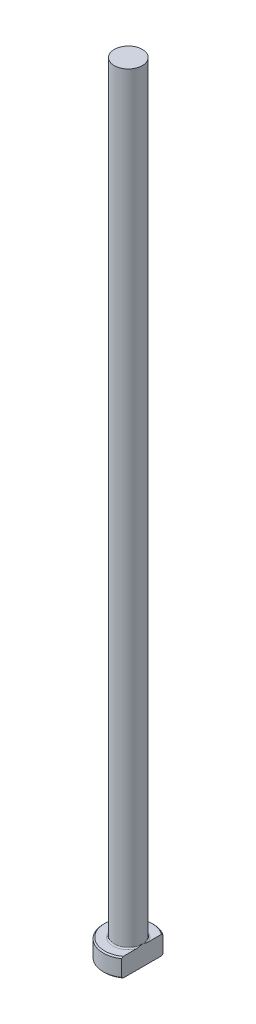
ISO-10303-21;
HEADER;
FILE_DESCRIPTION(('STEP AP214'),'2;1');
FILE_NAME('part.step','',(''),(''),'','','');
FILE_SCHEMA(('AUTOMOTIVE_DESIGN { 1 0 10303 214 1 1 1 1 }'));
ENDSEC;
DATA;
#1=APPLICATION_CONTEXT('core data for automotive mechanical design processes');
#2=APPLICATION_PROTOCOL_DEFINITION('international standard','automotive_design',2000,#1);
#3=PRODUCT_CONTEXT('',#1,'mechanical');
#4=PRODUCT('Part','Part','',(#3));
#5=PRODUCT_RELATED_PRODUCT_CATEGORY('part','',(#4));
#6=PRODUCT_DEFINITION_FORMATION('','',#4);
#7=PRODUCT_DEFINITION_CONTEXT('part definition',#1,'design');
#8=PRODUCT_DEFINITION('design','',#6,#7);
#9=PRODUCT_DEFINITION_SHAPE('','',#8);
#10=(LENGTH_UNIT() NAMED_UNIT(*) SI_UNIT(.MILLI.,.METRE.));
#11=(NAMED_UNIT(*) PLANE_ANGLE_UNIT() SI_UNIT($,.RADIAN.));
#12=(NAMED_UNIT(*) SI_UNIT($,.STERADIAN.) SOLID_ANGLE_UNIT());
#13=UNCERTAINTY_MEASURE_WITH_UNIT(LENGTH_MEASURE(1.E-05),#10,'distance_accuracy_value','');
#14=(GEOMETRIC_REPRESENTATION_CONTEXT(3) GLOBAL_UNCERTAINTY_ASSIGNED_CONTEXT((#13)) GLOBAL_UNIT_ASSIGNED_CONTEXT((#10,
#11,#12)) REPRESENTATION_CONTEXT('',''));
#15=CARTESIAN_POINT('',(0.,0.,0.));
#16=DIRECTION('',(0.,0.,1.));
#17=DIRECTION('',(1.,0.,0.));
#18=AXIS2_PLACEMENT_3D('',#15,#16,#17);
#19=CARTESIAN_POINT('',(0.,0.,0.));
#20=DIRECTION('',(0.,-1.,0.));
#21=DIRECTION('',(0.,0.,-1.));
#22=AXIS2_PLACEMENT_3D('',#19,#20,#21);
#23=PLANE('',#22);
#24=CARTESIAN_POINT('',(0.,0.,0.));
#25=DIRECTION('',(0.,-1.,0.));
#26=DIRECTION('',(0.,0.,-1.));
#27=AXIS2_PLACEMENT_3D('',#24,#25,#26);
#28=CIRCLE('',#27,3.79999999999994);
#29=CARTESIAN_POINT('',(2.24999999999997,0.,3.06227039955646));
#30=VERTEX_POINT('',#29);
#31=CARTESIAN_POINT('',(2.24999999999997,0.,-3.06227039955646));
#32=VERTEX_POINT('',#31);
#33=EDGE_CURVE('E98',#30,#32,#28,.T.);
#34=ORIENTED_EDGE('',*,*,#33,.T.);
#35=DIRECTION('',(0.,0.,1.));
#36=VECTOR('',#35,1.);
#37=CARTESIAN_POINT('',(2.24999999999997,0.,-3.30718913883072));
#38=LINE('',#37,#36);
#39=EDGE_CURVE('E83',#32,#30,#38,.T.);
#40=ORIENTED_EDGE('',*,*,#39,.T.);
#41=EDGE_LOOP('',(#34,#40));
#42=FACE_BOUND('',#41,.T.);
#43=ADVANCED_FACE('F32',(#42),#23,.T.);
#44=CARTESIAN_POINT('',(0.,259.958771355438,0.));
#45=DIRECTION('',(0.,1.,0.));
#46=DIRECTION('',(0.,0.,1.));
#47=AXIS2_PLACEMENT_3D('',#44,#45,#46);
#48=CYLINDRICAL_SURFACE('',#47,3.99999999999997);
#49=CARTESIAN_POINT('',(0.,2.79999999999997,0.));
#50=DIRECTION('',(0.,1.,0.));
#51=DIRECTION('',(0.,0.,1.));
#52=AXIS2_PLACEMENT_3D('',#49,#50,#51);
#53=CIRCLE('',#52,3.99999999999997);
#54=CARTESIAN_POINT('',(2.24999999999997,2.79999999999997,3.30718913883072));
#55=VERTEX_POINT('',#54);
#56=CARTESIAN_POINT('',(2.24999999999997,2.79999999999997,-3.30718913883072));
#57=VERTEX_POINT('',#56);
#58=EDGE_CURVE('E104',#55,#57,#53,.F.);
#59=ORIENTED_EDGE('',*,*,#58,.T.);
#60=DIRECTION('',(0.,-1.,0.));
#61=VECTOR('',#60,1.);
#62=CARTESIAN_POINT('',(2.24999999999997,125.,-3.30718913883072));
#63=LINE('',#62,#61);
#64=CARTESIAN_POINT('',(2.24999999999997,0.200000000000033,-3.30718913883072));
#65=VERTEX_POINT('',#64);
#66=EDGE_CURVE('E183',#57,#65,#63,.T.);
#67=ORIENTED_EDGE('',*,*,#66,.T.);
#68=CARTESIAN_POINT('',(0.,0.200000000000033,0.));
#69=DIRECTION('',(0.,-1.,0.));
#70=DIRECTION('',(0.,0.,-1.));
#71=AXIS2_PLACEMENT_3D('',#68,#69,#70);
#72=CIRCLE('',#71,3.99999999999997);
#73=CARTESIAN_POINT('',(2.24999999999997,0.200000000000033,3.30718913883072));
#74=VERTEX_POINT('',#73);
#75=EDGE_CURVE('E100',#65,#74,#72,.F.);
#76=ORIENTED_EDGE('',*,*,#75,.T.);
#77=DIRECTION('',(0.,-1.,0.));
#78=VECTOR('',#77,1.);
#79=CARTESIAN_POINT('',(2.24999999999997,125.,3.30718913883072));
#80=LINE('',#79,#78);
#81=EDGE_CURVE('E93',#55,#74,#80,.T.);
#82=ORIENTED_EDGE('',*,*,#81,.F.);
#83=EDGE_LOOP('',(#59,#67,#76,#82));
#84=FACE_BOUND('',#83,.T.);
#85=ADVANCED_FACE('F158',(#84),#48,.T.);
#86=CARTESIAN_POINT('',(-3.99999999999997,3.,0.));
#87=DIRECTION('',(0.,1.,0.));
#88=DIRECTION('',(0.,0.,1.));
#89=AXIS2_PLACEMENT_3D('',#86,#87,#88);
#90=PLANE('',#89);
#91=CARTESIAN_POINT('',(0.,3.,0.));
#92=DIRECTION('',(0.,1.,0.));
#93=DIRECTION('',(0.,0.,1.));
#94=AXIS2_PLACEMENT_3D('',#91,#92,#93);
#95=CIRCLE('',#94,3.79999999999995);
#96=CARTESIAN_POINT('',(2.24999999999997,3.,-3.06227039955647));
#97=VERTEX_POINT('',#96);
#98=CARTESIAN_POINT('',(2.24999999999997,3.,3.06227039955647));
#99=VERTEX_POINT('',#98);
#100=EDGE_CURVE('E178',#97,#99,#95,.T.);
#101=ORIENTED_EDGE('',*,*,#100,.T.);
#102=DIRECTION('',(0.,0.,-1.));
#103=VECTOR('',#102,1.);
#104=CARTESIAN_POINT('',(2.24999999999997,3.,0.));
#105=LINE('',#104,#103);
#106=CARTESIAN_POINT('',(2.24999999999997,2.99999999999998,0.969535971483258));
#107=VERTEX_POINT('',#106);
#108=EDGE_CURVE('E57',#99,#107,#105,.T.);
#109=ORIENTED_EDGE('',*,*,#108,.T.);
#110=CARTESIAN_POINT('',(0.,3.,0.));
#111=DIRECTION('',(0.,1.,0.));
#112=DIRECTION('',(0.,0.,1.));
#113=AXIS2_PLACEMENT_3D('',#110,#111,#112);
#114=CIRCLE('',#113,2.44999999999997);
#115=CARTESIAN_POINT('',(2.24999999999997,2.99999999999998,-0.969535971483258));
#116=VERTEX_POINT('',#115);
#117=EDGE_CURVE('E107',#107,#116,#114,.F.);
#118=ORIENTED_EDGE('',*,*,#117,.T.);
#119=EDGE_CURVE('E136',#116,#97,#105,.T.);
#120=ORIENTED_EDGE('',*,*,#119,.T.);
#121=EDGE_LOOP('',(#101,#109,#118,#120));
#122=FACE_BOUND('',#121,.T.);
#123=ADVANCED_FACE('F147',(#122),#90,.T.);
#124=CARTESIAN_POINT('',(0.,3.,0.));
#125=DIRECTION('',(0.,-1.,0.));
#126=DIRECTION('',(0.,0.,-1.));
#127=AXIS2_PLACEMENT_3D('',#124,#125,#126);
#128=CONICAL_SURFACE('',#127,3.79999999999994,0.785398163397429);
#129=ORIENTED_EDGE('',*,*,#58,.F.);
#130=CARTESIAN_POINT('',(2.24999999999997,-0.817697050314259,7.27782992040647));
#131=CARTESIAN_POINT('',(2.24999999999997,-0.691332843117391,7.14556140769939));
#132=CARTESIAN_POINT('',(2.24999999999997,-0.56512225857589,7.01314597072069));
#133=CARTESIAN_POINT('',(2.24999999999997,-0.313071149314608,6.74796170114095));
#134=CARTESIAN_POINT('',(2.24999999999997,-0.187230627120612,6.61519286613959));
#135=CARTESIAN_POINT('',(2.24999999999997,0.189705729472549,6.21619905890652));
#136=CARTESIAN_POINT('',(2.24999999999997,0.440149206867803,5.94935693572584));
#137=CARTESIAN_POINT('',(2.24999999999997,0.940260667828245,5.41146981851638));
#138=CARTESIAN_POINT('',(2.24999999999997,1.18991116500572,5.14040850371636));
#139=CARTESIAN_POINT('',(2.24999999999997,1.56140055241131,4.7311368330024));
#140=CARTESIAN_POINT('',(2.24999999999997,1.68472451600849,4.59427552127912));
#141=CARTESIAN_POINT('',(2.24999999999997,1.9300940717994,4.31941326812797));
#142=CARTESIAN_POINT('',(2.24999999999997,2.05213967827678,4.18141233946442));
#143=CARTESIAN_POINT('',(2.24999999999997,2.31419582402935,3.88150807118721));
#144=CARTESIAN_POINT('',(2.24999999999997,2.45391708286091,3.71935099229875));
#145=CARTESIAN_POINT('',(2.24999999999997,2.73025215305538,3.39234412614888));
#146=CARTESIAN_POINT('',(2.24999999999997,2.86686529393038,3.22749377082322));
#147=CARTESIAN_POINT('',(2.24999999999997,3.13534139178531,2.8943084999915));
#148=CARTESIAN_POINT('',(2.24999999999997,3.26721073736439,2.72597879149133));
#149=CARTESIAN_POINT('',(2.24999999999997,3.45966785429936,2.46950762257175));
#150=CARTESIAN_POINT('',(2.24999999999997,3.52291962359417,2.3833682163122));
#151=CARTESIAN_POINT('',(2.24999999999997,3.64714184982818,2.20946418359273));
#152=CARTESIAN_POINT('',(2.24999999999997,3.70811252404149,2.12169971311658));
#153=CARTESIAN_POINT('',(2.24999999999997,3.82102230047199,1.95327886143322));
#154=CARTESIAN_POINT('',(2.24999999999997,3.8732469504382,1.87281476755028));
#155=CARTESIAN_POINT('',(2.24999999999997,3.97467249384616,1.70998172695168));
#156=CARTESIAN_POINT('',(2.24999999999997,4.02387305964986,1.62761257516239));
#157=CARTESIAN_POINT('',(2.24999999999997,4.11837607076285,1.46059799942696));
#158=CARTESIAN_POINT('',(2.24999999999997,4.16367708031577,1.3759517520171));
#159=CARTESIAN_POINT('',(2.24999999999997,4.24914050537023,1.20413766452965));
#160=CARTESIAN_POINT('',(2.24999999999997,4.28930406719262,1.11697039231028));
#161=CARTESIAN_POINT('',(2.24999999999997,4.38314726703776,0.891175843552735));
#162=CARTESIAN_POINT('',(2.24999999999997,4.43219749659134,0.750488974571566));
#163=CARTESIAN_POINT('',(2.24999999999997,4.48826674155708,0.535159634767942));
#164=CARTESIAN_POINT('',(2.24999999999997,4.50402844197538,0.462776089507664));
#165=CARTESIAN_POINT('',(2.24999999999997,4.5289338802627,0.316860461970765));
#166=CARTESIAN_POINT('',(2.24999999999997,4.53807847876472,0.243328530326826));
#167=CARTESIAN_POINT('',(2.24999999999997,4.54922474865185,0.0949504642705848));
#168=CARTESIAN_POINT('',(2.24999999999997,4.55115152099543,0.020098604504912));
#169=CARTESIAN_POINT('',(2.24999999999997,4.54752076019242,-0.129420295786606));
#170=CARTESIAN_POINT('',(2.24999999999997,4.54196316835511,-0.204087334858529));
#171=CARTESIAN_POINT('',(2.24999999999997,4.5237232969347,-0.352688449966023));
#172=CARTESIAN_POINT('',(2.24999999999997,4.51102617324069,-0.426620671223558));
#173=CARTESIAN_POINT('',(2.24999999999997,4.47926333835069,-0.573094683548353));
#174=CARTESIAN_POINT('',(2.24999999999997,4.46019612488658,-0.645636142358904));
#175=CARTESIAN_POINT('',(2.24999999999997,4.40610994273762,-0.823701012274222));
#176=CARTESIAN_POINT('',(2.24999999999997,4.36783449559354,-0.928230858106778));
#177=CARTESIAN_POINT('',(2.24999999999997,4.28232692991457,-1.13354070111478));
#178=CARTESIAN_POINT('',(2.24999999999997,4.23508812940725,-1.23431783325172));
#179=CARTESIAN_POINT('',(2.24999999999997,4.13380125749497,-1.43298762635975));
#180=CARTESIAN_POINT('',(2.24999999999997,4.07972026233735,-1.53086330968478));
#181=CARTESIAN_POINT('',(2.24999999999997,3.99496203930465,-1.67548648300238));
#182=CARTESIAN_POINT('',(2.24999999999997,3.96610811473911,-1.72332162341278));
#183=CARTESIAN_POINT('',(2.24999999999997,3.90734436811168,-1.81833709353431));
#184=CARTESIAN_POINT('',(2.24999999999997,3.87743458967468,-1.86551745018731));
#185=CARTESIAN_POINT('',(2.24999999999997,3.77509597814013,-2.02354622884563));
#186=CARTESIAN_POINT('',(2.24999999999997,3.70057106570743,-2.13303820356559));
#187=CARTESIAN_POINT('',(2.24999999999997,3.547846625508,-2.34943854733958));
#188=CARTESIAN_POINT('',(2.24999999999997,3.46964624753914,-2.45634630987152));
#189=CARTESIAN_POINT('',(2.24999999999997,3.31046802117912,-2.66818697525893));
#190=CARTESIAN_POINT('',(2.24999999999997,3.22948822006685,-2.7731184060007));
#191=CARTESIAN_POINT('',(2.24999999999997,3.06545223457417,-2.98134898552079));
#192=CARTESIAN_POINT('',(2.24999999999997,2.98239592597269,-3.08464803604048));
#193=CARTESIAN_POINT('',(2.24999999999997,2.73044258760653,-3.39308007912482));
#194=CARTESIAN_POINT('',(2.24999999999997,2.55914389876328,-3.59624854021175));
#195=CARTESIAN_POINT('',(2.24999999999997,2.21260420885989,-3.99901521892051));
#196=CARTESIAN_POINT('',(2.24999999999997,2.03736490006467,-4.19861490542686));
#197=CARTESIAN_POINT('',(2.24999999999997,1.68403823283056,-4.59551245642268));
#198=CARTESIAN_POINT('',(2.24999999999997,1.50594904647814,-4.79280869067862));
#199=CARTESIAN_POINT('',(2.24999999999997,1.14782580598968,-5.18566037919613));
#200=CARTESIAN_POINT('',(2.24999999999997,0.96779155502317,-5.38121565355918));
#201=CARTESIAN_POINT('',(2.24999999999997,0.606519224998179,-5.77078870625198));
#202=CARTESIAN_POINT('',(2.24999999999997,0.425282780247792,-5.96480800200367));
#203=CARTESIAN_POINT('',(2.24999999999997,0.0617463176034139,-6.35184762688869));
#204=CARTESIAN_POINT('',(2.24999999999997,-0.12055370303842,-6.54486795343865));
#205=CARTESIAN_POINT('',(2.24999999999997,-0.388876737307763,-6.82775668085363));
#206=CARTESIAN_POINT('',(2.24999999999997,-0.474578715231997,-6.91792994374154));
#207=CARTESIAN_POINT('',(2.24999999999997,-0.646062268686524,-7.09803491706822));
#208=CARTESIAN_POINT('',(2.24999999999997,-0.73184368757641,-7.18796677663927));
#209=CARTESIAN_POINT('',(2.24999999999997,-0.817697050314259,-7.27782992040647));
#210=B_SPLINE_CURVE_WITH_KNOTS('',3,(#130,#131,#132,#133,#134,#135,#136,#137,#138,#139,#140,
#141,#142,#143,#144,#145,#146,#147,#148,#149,#150,#151,#152,#153,#154,#155,#156,#157,#158,#159,
#160,#161,#162,#163,#164,#165,#166,#167,#168,#169,#170,#171,#172,#173,#174,#175,#176,#177,#178,
#179,#180,#181,#182,#183,#184,#185,#186,#187,#188,#189,#190,#191,#192,#193,#194,#195,#196,#197,
#198,#199,#200,#201,#202,#203,#204,#205,#206,#207,#208,#209),.UNSPECIFIED.,.F.,.F.,(4,2,2,2,2,2,
2,2,2,2,2,2,2,2,2,2,2,2,2,2,2,2,2,2,2,2,2,2,2,2,2,2,2,2,2,2,2,2,2,4),(0.,0.548785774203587,
1.09757528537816,2.19544562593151,3.30094607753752,3.85362276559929,4.40629327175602,
5.04841012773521,5.69066421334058,6.33201824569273,6.65259523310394,6.97314160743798,
7.26086761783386,7.54862474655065,7.83648737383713,8.12428565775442,8.56956070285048,
8.79154735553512,9.01350513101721,9.23775987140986,9.46201637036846,9.68674086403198,
9.91151839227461,10.2448678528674,10.5784668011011,10.9137368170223,11.0813178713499,
11.2488920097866,11.6461164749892,12.0434332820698,12.4410351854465,12.8386609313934,
13.6357991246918,14.43260129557,15.2299368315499,16.0273538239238,16.8238479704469,
17.6203441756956,17.9935523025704,18.3664002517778),.UNSPECIFIED.);
#211=EDGE_CURVE('E135',#55,#99,#210,.T.);
#212=ORIENTED_EDGE('',*,*,#211,.T.);
#213=ORIENTED_EDGE('',*,*,#100,.F.);
#214=EDGE_CURVE('E127',#97,#57,#210,.T.);
#215=ORIENTED_EDGE('',*,*,#214,.T.);
#216=EDGE_LOOP('',(#129,#212,#213,#215));
#217=FACE_BOUND('',#216,.T.);
#218=ADVANCED_FACE('F143',(#217),#128,.T.);
#219=CARTESIAN_POINT('',(0.,0.200000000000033,0.));
#220=DIRECTION('',(0.,1.,0.));
#221=DIRECTION('',(0.,0.,1.));
#222=AXIS2_PLACEMENT_3D('',#219,#220,#221);
#223=CONICAL_SURFACE('',#222,3.99999999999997,0.785398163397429);
#224=ORIENTED_EDGE('',*,*,#75,.F.);
#225=CARTESIAN_POINT('',(2.24999999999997,3.81769705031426,-7.27782992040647));
#226=CARTESIAN_POINT('',(2.24999999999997,3.69133284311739,-7.14556140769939));
#227=CARTESIAN_POINT('',(2.24999999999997,3.56512225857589,-7.01314597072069));
#228=CARTESIAN_POINT('',(2.24999999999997,3.31307114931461,-6.74796170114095));
#229=CARTESIAN_POINT('',(2.24999999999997,3.18723062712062,-6.61519286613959));
#230=CARTESIAN_POINT('',(2.24999999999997,2.81029427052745,-6.21619905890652));
#231=CARTESIAN_POINT('',(2.24999999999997,2.5598507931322,-5.94935693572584));
#232=CARTESIAN_POINT('',(2.24999999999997,2.05973933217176,-5.41146981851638));
#233=CARTESIAN_POINT('',(2.24999999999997,1.81008883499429,-5.14040850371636));
#234=CARTESIAN_POINT('',(2.24999999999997,1.43859944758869,-4.73113683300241));
#235=CARTESIAN_POINT('',(2.24999999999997,1.31527548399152,-4.59427552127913));
#236=CARTESIAN_POINT('',(2.24999999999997,1.06990592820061,-4.31941326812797));
#237=CARTESIAN_POINT('',(2.24999999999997,0.947860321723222,-4.18141233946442));
#238=CARTESIAN_POINT('',(2.24999999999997,0.685804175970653,-3.88150807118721));
#239=CARTESIAN_POINT('',(2.24999999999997,0.54608291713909,-3.71935099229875));
#240=CARTESIAN_POINT('',(2.24999999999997,0.269747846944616,-3.39234412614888));
#241=CARTESIAN_POINT('',(2.24999999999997,0.133134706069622,-3.22749377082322));
#242=CARTESIAN_POINT('',(2.24999999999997,-0.135341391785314,-2.89430849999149));
#243=CARTESIAN_POINT('',(2.24999999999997,-0.267210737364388,-2.72597879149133));
#244=CARTESIAN_POINT('',(2.24999999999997,-0.459667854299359,-2.46950762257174));
#245=CARTESIAN_POINT('',(2.24999999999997,-0.522919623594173,-2.38336821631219));
#246=CARTESIAN_POINT('',(2.24999999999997,-0.647141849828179,-2.20946418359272));
#247=CARTESIAN_POINT('',(2.24999999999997,-0.708112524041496,-2.12169971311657));
#248=CARTESIAN_POINT('',(2.24999999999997,-0.821022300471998,-1.95327886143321));
#249=CARTESIAN_POINT('',(2.24999999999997,-0.873246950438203,-1.87281476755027));
#250=CARTESIAN_POINT('',(2.24999999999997,-0.974672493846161,-1.70998172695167));
#251=CARTESIAN_POINT('',(2.24999999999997,-1.02387305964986,-1.62761257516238));
#252=CARTESIAN_POINT('',(2.24999999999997,-1.11837607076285,-1.46059799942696));
#253=CARTESIAN_POINT('',(2.24999999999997,-1.16367708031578,-1.37595175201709));
#254=CARTESIAN_POINT('',(2.24999999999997,-1.24914050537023,-1.20413766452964));
#255=CARTESIAN_POINT('',(2.24999999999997,-1.28930406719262,-1.11697039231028));
#256=CARTESIAN_POINT('',(2.24999999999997,-1.38314726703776,-0.891175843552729));
#257=CARTESIAN_POINT('',(2.24999999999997,-1.43219749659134,-0.750488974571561));
#258=CARTESIAN_POINT('',(2.24999999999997,-1.48826674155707,-0.535159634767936));
#259=CARTESIAN_POINT('',(2.24999999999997,-1.50402844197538,-0.462776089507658));
#260=CARTESIAN_POINT('',(2.24999999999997,-1.5289338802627,-0.31686046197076));
#261=CARTESIAN_POINT('',(2.24999999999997,-1.53807847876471,-0.243328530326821));
#262=CARTESIAN_POINT('',(2.24999999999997,-1.54922474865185,-0.0949504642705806));
#263=CARTESIAN_POINT('',(2.24999999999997,-1.55115152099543,-0.0200986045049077));
#264=CARTESIAN_POINT('',(2.24999999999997,-1.54752076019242,0.12942029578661));
#265=CARTESIAN_POINT('',(2.24999999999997,-1.54196316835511,0.204087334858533));
#266=CARTESIAN_POINT('',(2.24999999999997,-1.5237232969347,0.352688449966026));
#267=CARTESIAN_POINT('',(2.24999999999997,-1.51102617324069,0.42662067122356));
#268=CARTESIAN_POINT('',(2.24999999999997,-1.47926333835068,0.573094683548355));
#269=CARTESIAN_POINT('',(2.24999999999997,-1.46019612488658,0.645636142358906));
#270=CARTESIAN_POINT('',(2.24999999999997,-1.40610994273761,0.823701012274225));
#271=CARTESIAN_POINT('',(2.24999999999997,-1.36783449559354,0.928230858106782));
#272=CARTESIAN_POINT('',(2.24999999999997,-1.28232692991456,1.13354070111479));
#273=CARTESIAN_POINT('',(2.24999999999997,-1.23508812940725,1.23431783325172));
#274=CARTESIAN_POINT('',(2.24999999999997,-1.13380125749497,1.43298762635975));
#275=CARTESIAN_POINT('',(2.24999999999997,-1.07972026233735,1.53086330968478));
#276=CARTESIAN_POINT('',(2.24999999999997,-0.994962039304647,1.67548648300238));
#277=CARTESIAN_POINT('',(2.24999999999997,-0.966108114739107,1.72332162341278));
#278=CARTESIAN_POINT('',(2.24999999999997,-0.90734436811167,1.81833709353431));
#279=CARTESIAN_POINT('',(2.24999999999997,-0.877434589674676,1.86551745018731));
#280=CARTESIAN_POINT('',(2.24999999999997,-0.775095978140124,2.02354622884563));
#281=CARTESIAN_POINT('',(2.24999999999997,-0.70057106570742,2.1330382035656));
#282=CARTESIAN_POINT('',(2.24999999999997,-0.547846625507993,2.34943854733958));
#283=CARTESIAN_POINT('',(2.24999999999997,-0.469646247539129,2.45634630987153));
#284=CARTESIAN_POINT('',(2.24999999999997,-0.310468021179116,2.66818697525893));
#285=CARTESIAN_POINT('',(2.24999999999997,-0.229488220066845,2.7731184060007));
#286=CARTESIAN_POINT('',(2.24999999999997,-0.0654522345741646,2.98134898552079));
#287=CARTESIAN_POINT('',(2.24999999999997,0.0176040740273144,3.08464803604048));
#288=CARTESIAN_POINT('',(2.24999999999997,0.269557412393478,3.39308007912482));
#289=CARTESIAN_POINT('',(2.24999999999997,0.440856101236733,3.59624854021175));
#290=CARTESIAN_POINT('',(2.24999999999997,0.787395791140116,3.99901521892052));
#291=CARTESIAN_POINT('',(2.24999999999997,0.962635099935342,4.19861490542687));
#292=CARTESIAN_POINT('',(2.24999999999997,1.31596176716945,4.59551245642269));
#293=CARTESIAN_POINT('',(2.24999999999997,1.49405095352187,4.79280869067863));
#294=CARTESIAN_POINT('',(2.24999999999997,1.85217419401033,5.18566037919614));
#295=CARTESIAN_POINT('',(2.24999999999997,2.03220844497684,5.38121565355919));
#296=CARTESIAN_POINT('',(2.24999999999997,2.39348077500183,5.770788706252));
#297=CARTESIAN_POINT('',(2.24999999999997,2.57471721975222,5.96480800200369));
#298=CARTESIAN_POINT('',(2.24999999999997,2.9382536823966,6.3518476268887));
#299=CARTESIAN_POINT('',(2.24999999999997,3.12055370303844,6.54486795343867));
#300=CARTESIAN_POINT('',(2.24999999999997,3.38887673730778,6.82775668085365));
#301=CARTESIAN_POINT('',(2.24999999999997,3.47457871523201,6.91792994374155));
#302=CARTESIAN_POINT('',(2.24999999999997,3.64606226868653,7.09803491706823));
#303=CARTESIAN_POINT('',(2.24999999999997,3.73184368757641,7.18796677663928));
#304=CARTESIAN_POINT('',(2.24999999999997,3.81769705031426,7.27782992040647));
#305=B_SPLINE_CURVE_WITH_KNOTS('',3,(#225,#226,#227,#228,#229,#230,#231,#232,#233,#234,#235,
#236,#237,#238,#239,#240,#241,#242,#243,#244,#245,#246,#247,#248,#249,#250,#251,#252,#253,#254,
#255,#256,#257,#258,#259,#260,#261,#262,#263,#264,#265,#266,#267,#268,#269,#270,#271,#272,#273,
#274,#275,#276,#277,#278,#279,#280,#281,#282,#283,#284,#285,#286,#287,#288,#289,#290,#291,#292,
#293,#294,#295,#296,#297,#298,#299,#300,#301,#302,#303,#304),.UNSPECIFIED.,.F.,.F.,(4,2,2,2,2,2,
2,2,2,2,2,2,2,2,2,2,2,2,2,2,2,2,2,2,2,2,2,2,2,2,2,2,2,2,2,2,2,2,2,4),(0.,0.548785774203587,
1.09757528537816,2.19544562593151,3.30094607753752,3.85362276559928,4.40629327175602,
5.04841012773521,5.69066421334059,6.33201824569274,6.65259523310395,6.97314160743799,
7.26086761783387,7.54862474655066,7.83648737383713,8.12428565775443,8.56956070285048,
8.79154735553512,9.01350513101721,9.23775987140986,9.46201637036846,9.68674086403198,
9.91151839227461,10.2448678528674,10.5784668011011,10.9137368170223,11.0813178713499,
11.2488920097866,11.6461164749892,12.0434332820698,12.4410351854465,12.8386609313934,
13.6357991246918,14.43260129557,15.2299368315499,16.0273538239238,16.8238479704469,
17.6203441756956,17.9935523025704,18.3664002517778),.UNSPECIFIED.);
#306=EDGE_CURVE('E86',#65,#32,#305,.T.);
#307=ORIENTED_EDGE('',*,*,#306,.T.);
#308=ORIENTED_EDGE('',*,*,#33,.F.);
#309=EDGE_CURVE('E89',#30,#74,#305,.T.);
#310=ORIENTED_EDGE('',*,*,#309,.T.);
#311=EDGE_LOOP('',(#224,#307,#308,#310));
#312=FACE_BOUND('',#311,.T.);
#313=ADVANCED_FACE('F97',(#312),#223,.T.);
#314=CARTESIAN_POINT('',(0.,3.19999999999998,0.));
#315=DIRECTION('',(0.,1.,0.));
#316=DIRECTION('',(0.,0.,1.));
#317=AXIS2_PLACEMENT_3D('',#314,#315,#316);
#318=TOROIDAL_SURFACE('',#317,2.44999999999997,0.2);
#319=CARTESIAN_POINT('',(2.24999999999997,3.19999999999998,0.));
#320=CARTESIAN_POINT('',(2.24999999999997,3.20000050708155,6.44726104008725E-11));
#321=CARTESIAN_POINT('',(2.24999999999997,3.20000101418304,-1.58891186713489E-07));
#322=CARTESIAN_POINT('',(2.24999999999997,3.20000197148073,-6.21779236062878E-07));
#323=CARTESIAN_POINT('',(2.24999999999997,3.20000241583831,-9.34460755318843E-07));
#324=CARTESIAN_POINT('',(2.24999999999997,3.20000332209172,-1.68105190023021E-06));
#325=CARTESIAN_POINT('',(2.24999999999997,3.20000377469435,-2.12646372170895E-06));
#326=CARTESIAN_POINT('',(2.24999999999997,3.20000460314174,-3.06333876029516E-06));
#327=CARTESIAN_POINT('',(2.24999999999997,3.2000049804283,-3.55360517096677E-06));
#328=CARTESIAN_POINT('',(2.24999999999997,3.20000633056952,-5.39956008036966E-06));
#329=CARTESIAN_POINT('',(2.24999999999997,3.20000722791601,-6.81237619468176E-06));
#330=CARTESIAN_POINT('',(2.24999999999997,3.20000875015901,-9.65315882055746E-06));
#331=CARTESIAN_POINT('',(2.24999999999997,3.2000093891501,-1.10739426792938E-05));
#332=CARTESIAN_POINT('',(2.24999999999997,3.20001197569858,-1.69289386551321E-05));
#333=CARTESIAN_POINT('',(2.24999999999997,3.20001384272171,-2.14029807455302E-05));
#334=CARTESIAN_POINT('',(2.24999999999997,3.20001668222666,-2.99701699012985E-05));
#335=CARTESIAN_POINT('',(2.24999999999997,3.20001774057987,-3.40349906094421E-05));
#336=CARTESIAN_POINT('',(2.24999999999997,3.20002529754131,-6.37611258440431E-05));
#337=CARTESIAN_POINT('',(2.24999999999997,3.20003087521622,-8.96095284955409E-05));
#338=CARTESIAN_POINT('',(2.24999999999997,3.20005527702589,-0.00019117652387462));
#339=CARTESIAN_POINT('',(2.24999999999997,3.20007870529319,-0.000265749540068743));
#340=CARTESIAN_POINT('',(2.24999999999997,3.2001693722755,-0.000559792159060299));
#341=CARTESIAN_POINT('',(2.24999999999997,3.20023350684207,-0.000779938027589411));
#342=CARTESIAN_POINT('',(2.24999999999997,3.20048920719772,-0.00165050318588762));
#343=CARTESIAN_POINT('',(2.24999999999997,3.20068459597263,-0.00230007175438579));
#344=CARTESIAN_POINT('',(2.24999999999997,3.20149322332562,-0.00499620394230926));
#345=CARTESIAN_POINT('',(2.24999999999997,3.20210170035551,-0.00704382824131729));
#346=CARTESIAN_POINT('',(2.24999999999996,3.2079710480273,-0.0267853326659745));
#347=CARTESIAN_POINT('',(2.24999999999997,3.21325284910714,-0.0444747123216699));
#348=CARTESIAN_POINT('',(2.24999999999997,3.22356918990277,-0.0791736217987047));
#349=CARTESIAN_POINT('',(2.24999999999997,3.22860532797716,-0.0961827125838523));
#350=CARTESIAN_POINT('',(2.24999999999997,3.23925368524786,-0.132326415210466));
#351=CARTESIAN_POINT('',(2.24999999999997,3.24485983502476,-0.151462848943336));
#352=CARTESIAN_POINT('',(2.24999999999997,3.25603662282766,-0.189968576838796));
#353=CARTESIAN_POINT('',(2.24999999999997,3.26160623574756,-0.209338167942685));
#354=CARTESIAN_POINT('',(2.24999999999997,3.27500311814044,-0.256523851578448));
#355=CARTESIAN_POINT('',(2.24999999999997,3.28276182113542,-0.284359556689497));
#356=CARTESIAN_POINT('',(2.24999999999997,3.29771346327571,-0.339425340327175));
#357=CARTESIAN_POINT('',(2.24999999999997,3.30491576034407,-0.36665287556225));
#358=CARTESIAN_POINT('',(2.24999999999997,3.32240345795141,-0.435090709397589));
#359=CARTESIAN_POINT('',(2.24999999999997,3.33239618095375,-0.476377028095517));
#360=CARTESIAN_POINT('',(2.24999999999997,3.35100390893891,-0.559624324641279));
#361=CARTESIAN_POINT('',(2.24999999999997,3.3596067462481,-0.601588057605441));
#362=CARTESIAN_POINT('',(2.24999999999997,3.37543235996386,-0.689258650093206));
#363=CARTESIAN_POINT('',(2.24999999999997,3.38248971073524,-0.73499643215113));
#364=CARTESIAN_POINT('',(2.24999999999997,3.39342529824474,-0.826730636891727));
#365=CARTESIAN_POINT('',(2.24999999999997,3.39731270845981,-0.872725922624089));
#366=CARTESIAN_POINT('',(2.24999999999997,3.40071499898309,-0.963783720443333));
#367=CARTESIAN_POINT('',(2.24999999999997,3.40033773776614,-1.00884048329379));
#368=CARTESIAN_POINT('',(2.24999999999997,3.39535803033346,-1.07577565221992));
#369=CARTESIAN_POINT('',(2.24999999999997,3.39299580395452,-1.09781842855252));
#370=CARTESIAN_POINT('',(2.24999999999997,3.38649339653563,-1.14163100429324));
#371=CARTESIAN_POINT('',(2.24999999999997,3.38235512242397,-1.16340107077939));
#372=CARTESIAN_POINT('',(2.24999999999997,3.37178290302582,-1.20664751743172));
#373=CARTESIAN_POINT('',(2.24999999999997,3.36532376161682,-1.2281178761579));
#374=CARTESIAN_POINT('',(2.24999999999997,3.34940253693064,-1.26994619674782));
#375=CARTESIAN_POINT('',(2.24999999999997,3.33994859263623,-1.29030700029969));
#376=CARTESIAN_POINT('',(2.24999999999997,3.32341167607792,-1.3178414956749));
#377=CARTESIAN_POINT('',(2.24999999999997,3.31797729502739,-1.32600125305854));
#378=CARTESIAN_POINT('',(2.24999999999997,3.30618383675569,-1.34165219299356));
#379=CARTESIAN_POINT('',(2.24999999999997,3.29982370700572,-1.34914259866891));
#380=CARTESIAN_POINT('',(2.24999999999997,3.28597385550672,-1.36322511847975));
#381=CARTESIAN_POINT('',(2.24999999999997,3.27846961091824,-1.36980324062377));
#382=CARTESIAN_POINT('',(2.24999999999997,3.26235014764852,-1.3814177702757));
#383=CARTESIAN_POINT('',(2.24999999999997,3.25373945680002,-1.38646019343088));
#384=CARTESIAN_POINT('',(2.24999999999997,3.23893119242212,-1.39291408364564));
#385=CARTESIAN_POINT('',(2.24999999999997,3.23301804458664,-1.39497873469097));
#386=CARTESIAN_POINT('',(2.24999999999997,3.22092968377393,-1.3980973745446));
#387=CARTESIAN_POINT('',(2.24999999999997,3.21475469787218,-1.39915222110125));
#388=CARTESIAN_POINT('',(2.24999999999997,3.20229305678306,-1.4001597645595));
#389=CARTESIAN_POINT('',(2.24999999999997,3.19600609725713,-1.40010876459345));
#390=CARTESIAN_POINT('',(2.24999999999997,3.18353929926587,-1.39890051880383));
#391=CARTESIAN_POINT('',(2.24999999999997,3.17735949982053,-1.39774287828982));
#392=CARTESIAN_POINT('',(2.24999999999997,3.16550896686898,-1.39448677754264));
#393=CARTESIAN_POINT('',(2.24999999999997,3.15982782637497,-1.39242539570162));
#394=CARTESIAN_POINT('',(2.24999999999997,3.14882191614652,-1.38751374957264));
#395=CARTESIAN_POINT('',(2.24999999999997,3.14349727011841,-1.38466321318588));
#396=CARTESIAN_POINT('',(2.24999999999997,3.13026923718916,-1.37647479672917));
#397=CARTESIAN_POINT('',(2.24999999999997,3.12266499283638,-1.37065399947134));
#398=CARTESIAN_POINT('',(2.24999999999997,3.10845647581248,-1.35789458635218));
#399=CARTESIAN_POINT('',(2.24999999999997,3.10185542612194,-1.3509525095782));
#400=CARTESIAN_POINT('',(2.24999999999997,3.0855320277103,-1.33150080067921));
#401=CARTESIAN_POINT('',(2.24999999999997,3.07660573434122,-1.31832816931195));
#402=CARTESIAN_POINT('',(2.24999999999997,3.06078136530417,-1.29086374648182));
#403=CARTESIAN_POINT('',(2.24999999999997,3.05388481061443,-1.27657112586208));
#404=CARTESIAN_POINT('',(2.24999999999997,3.03602738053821,-1.23377116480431));
#405=CARTESIAN_POINT('',(2.24999999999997,3.02722778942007,-1.20437236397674));
#406=CARTESIAN_POINT('',(2.24999999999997,3.01362163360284,-1.14441037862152));
#407=CARTESIAN_POINT('',(2.24999999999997,3.00886464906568,-1.11383741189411));
#408=CARTESIAN_POINT('',(2.24999999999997,3.00105881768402,-1.03966563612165));
#409=CARTESIAN_POINT('',(2.24999999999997,2.99953171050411,-0.995912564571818));
#410=CARTESIAN_POINT('',(2.24999999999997,3.00070174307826,-0.908367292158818));
#411=CARTESIAN_POINT('',(2.24999999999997,3.00341475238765,-0.86457556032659));
#412=CARTESIAN_POINT('',(2.24999999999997,3.01171554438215,-0.779778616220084));
#413=CARTESIAN_POINT('',(2.24999999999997,3.01713219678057,-0.738755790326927));
#414=CARTESIAN_POINT('',(2.24999999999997,3.03001638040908,-0.657360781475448));
#415=CARTESIAN_POINT('',(2.24999999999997,3.03746816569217,-0.616986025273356));
#416=CARTESIAN_POINT('',(2.24999999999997,3.05405724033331,-0.535981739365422));
#417=CARTESIAN_POINT('',(2.24999999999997,3.06321733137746,-0.495356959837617));
#418=CARTESIAN_POINT('',(2.24999999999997,3.0829739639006,-0.413374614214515));
#419=CARTESIAN_POINT('',(2.24999999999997,3.09360096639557,-0.372024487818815));
#420=CARTESIAN_POINT('',(2.24999999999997,3.11230155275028,-0.302306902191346));
#421=CARTESIAN_POINT('',(2.24999999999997,3.12014883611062,-0.273877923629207));
#422=CARTESIAN_POINT('',(2.24999999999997,3.13605900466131,-0.217411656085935));
#423=CARTESIAN_POINT('',(2.24999999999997,3.14411864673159,-0.189373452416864));
#424=CARTESIAN_POINT('',(2.24999999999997,3.15951571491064,-0.136466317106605));
#425=CARTESIAN_POINT('',(2.24999999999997,3.1668337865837,-0.111591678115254));
#426=CARTESIAN_POINT('',(2.24999999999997,3.18187191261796,-0.0608432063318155));
#427=CARTESIAN_POINT('',(2.24999999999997,3.18959608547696,-0.0349705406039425));
#428=CARTESIAN_POINT('',(2.24999999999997,3.19789887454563,-0.00704171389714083));
#429=CARTESIAN_POINT('',(2.24999999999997,3.19850801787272,-0.00499199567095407));
#430=CARTESIAN_POINT('',(2.24999999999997,3.19931680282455,-0.0022953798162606));
#431=CARTESIAN_POINT('',(2.24999999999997,3.19951170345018,-0.00164742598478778));
#432=CARTESIAN_POINT('',(2.24999999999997,3.19976680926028,-0.000778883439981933));
#433=CARTESIAN_POINT('',(2.24999999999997,3.19983082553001,-0.00055914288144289));
#434=CARTESIAN_POINT('',(2.24999999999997,3.19992134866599,-0.000265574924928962));
#435=CARTESIAN_POINT('',(2.24999999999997,3.19994475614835,-0.00019107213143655));
#436=CARTESIAN_POINT('',(2.24999999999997,3.19996913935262,-8.95867306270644E-05));
#437=CARTESIAN_POINT('',(2.24999999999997,3.19997471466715,-6.37485903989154E-05));
#438=CARTESIAN_POINT('',(2.24999999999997,3.1999822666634,-3.40328341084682E-05));
#439=CARTESIAN_POINT('',(2.24999999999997,3.19998332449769,-2.9968622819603E-05));
#440=CARTESIAN_POINT('',(2.24999999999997,3.19998616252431,-2.14026473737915E-05));
#441=CARTESIAN_POINT('',(2.24999999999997,3.19998802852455,-1.69291778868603E-05));
#442=CARTESIAN_POINT('',(2.24999999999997,3.19999061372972,-1.10747627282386E-05));
#443=CARTESIAN_POINT('',(2.24999999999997,3.19999125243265,-9.654024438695E-06));
#444=CARTESIAN_POINT('',(2.24999999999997,3.19999277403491,-6.81328215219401E-06));
#445=CARTESIAN_POINT('',(2.24999999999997,3.19999367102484,-5.40045583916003E-06));
#446=CARTESIAN_POINT('',(2.24999999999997,3.19999502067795,-3.55442702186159E-06));
#447=CARTESIAN_POINT('',(2.24999999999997,3.19999539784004,-3.06412583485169E-06));
#448=CARTESIAN_POINT('',(2.24999999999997,3.19999622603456,-2.12715879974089E-06));
#449=CARTESIAN_POINT('',(2.24999999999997,3.19999667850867,-1.68168917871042E-06));
#450=CARTESIAN_POINT('',(2.24999999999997,3.19999758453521,-9.34960575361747E-07));
#451=CARTESIAN_POINT('',(2.24999999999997,3.19999802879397,-6.22203836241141E-07));
#452=CARTESIAN_POINT('',(2.24999999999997,3.1999989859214,-1.59128804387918E-07));
#453=CARTESIAN_POINT('',(2.24999999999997,3.19999949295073,-6.44685022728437E-11));
#454=CARTESIAN_POINT('',(2.24999999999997,3.19999999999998,0.));
#455=B_SPLINE_CURVE_WITH_KNOTS('',3,(#319,#320,#321,#322,#323,#324,#325,#326,#327,#328,#329,
#330,#331,#332,#333,#334,#335,#336,#337,#338,#339,#340,#341,#342,#343,#344,#345,#346,#347,#348,
#349,#350,#351,#352,#353,#354,#355,#356,#357,#358,#359,#360,#361,#362,#363,#364,#365,#366,#367,
#368,#369,#370,#371,#372,#373,#374,#375,#376,#377,#378,#379,#380,#381,#382,#383,#384,#385,#386,
#387,#388,#389,#390,#391,#392,#393,#394,#395,#396,#397,#398,#399,#400,#401,#402,#403,#404,#405,
#406,#407,#408,#409,#410,#411,#412,#413,#414,#415,#416,#417,#418,#419,#420,#421,#422,#423,#424,
#425,#426,#427,#428,#429,#430,#431,#432,#433,#434,#435,#436,#437,#438,#439,#440,#441,#442,#443,
#444,#445,#446,#447,#448,#449,#450,#451,#452,#453,#454),.UNSPECIFIED.,.T.,.F.,(4,2,2,2,2,2,2,2,
2,2,2,2,2,2,2,2,2,2,2,2,2,2,2,2,2,2,2,2,2,2,2,2,2,2,2,2,2,2,2,2,2,2,2,2,2,2,2,2,2,2,2,2,2,2,2,2,
2,2,2,2,2,2,2,2,2,2,2,4),(0.,1.52660891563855E-06,3.1524133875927E-06,5.04759848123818E-06,
6.90201355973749E-06,1.19024884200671E-05,1.65722258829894E-05,3.10841862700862E-05,
4.36688554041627E-05,0.000123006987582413,0.000357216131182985,0.00104540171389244,
0.00308000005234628,0.00948876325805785,0.0648698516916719,0.118087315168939,0.17790910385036,
0.238372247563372,0.325060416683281,0.40955017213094,0.536965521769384,0.665442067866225,
0.804194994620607,0.942544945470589,1.07740386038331,1.14385780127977,1.21024056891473,
1.27736693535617,1.34431241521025,1.37367425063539,1.40306973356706,1.43287536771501,
1.46256269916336,1.48127715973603,1.49997570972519,1.51873677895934,1.53750454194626,
1.55556541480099,1.57363252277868,1.60219661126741,1.63085061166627,1.67831692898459,
1.72581872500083,1.81736829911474,1.91002510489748,2.04102939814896,2.17252517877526,
2.29658958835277,2.41972004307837,2.54462990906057,2.67269769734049,2.76117244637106,
2.84869182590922,2.92647873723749,3.00747864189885,3.01389398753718,3.01592352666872,
3.016610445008,3.0168444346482,3.01692374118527,3.01693632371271,3.01695083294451,
3.01695550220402,3.01696050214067,3.01696235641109,3.01696425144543,3.01696587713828,
3.01696740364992),.UNSPECIFIED.);
#456=CARTESIAN_POINT('',(2.24999999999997,3.19999999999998,0.));
#457=VERTEX_POINT('',#456);
#458=EDGE_CURVE('E11',#116,#457,#455,.T.);
#459=ORIENTED_EDGE('',*,*,#458,.F.);
#460=ORIENTED_EDGE('',*,*,#117,.F.);
#461=CARTESIAN_POINT('',(2.24999999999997,3.19999999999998,0.));
#462=CARTESIAN_POINT('',(2.24999999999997,3.19999949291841,-6.44726152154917E-11));
#463=CARTESIAN_POINT('',(2.24999999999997,3.19999898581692,1.58891186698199E-07));
#464=CARTESIAN_POINT('',(2.24999999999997,3.19999802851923,6.21779236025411E-07));
#465=CARTESIAN_POINT('',(2.24999999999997,3.19999758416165,9.34460755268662E-07));
#466=CARTESIAN_POINT('',(2.24999999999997,3.19999667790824,1.68105190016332E-06));
#467=CARTESIAN_POINT('',(2.24999999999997,3.19999622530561,2.12646372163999E-06));
#468=CARTESIAN_POINT('',(2.24999999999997,3.19999539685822,3.06333876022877E-06));
#469=CARTESIAN_POINT('',(2.24999999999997,3.19999501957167,3.55360517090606E-06));
#470=CARTESIAN_POINT('',(2.24999999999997,3.19999366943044,5.39956008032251E-06));
#471=CARTESIAN_POINT('',(2.24999999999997,3.19999277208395,6.81237619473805E-06));
#472=CARTESIAN_POINT('',(2.24999999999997,3.19999124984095,9.65315882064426E-06));
#473=CARTESIAN_POINT('',(2.24999999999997,3.19999061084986,1.10739426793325E-05));
#474=CARTESIAN_POINT('',(2.24999999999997,3.19998802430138,1.69289386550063E-05));
#475=CARTESIAN_POINT('',(2.24999999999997,3.19998615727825,2.14029807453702E-05));
#476=CARTESIAN_POINT('',(2.24999999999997,3.1999833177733,2.99701699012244E-05));
#477=CARTESIAN_POINT('',(2.24999999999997,3.19998225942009,3.40349906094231E-05));
#478=CARTESIAN_POINT('',(2.24999999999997,3.19997470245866,6.37611258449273E-05));
#479=CARTESIAN_POINT('',(2.24999999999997,3.19996912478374,8.96095284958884E-05));
#480=CARTESIAN_POINT('',(2.24999999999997,3.19994472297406,0.000191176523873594));
#481=CARTESIAN_POINT('',(2.24999999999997,3.19992129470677,0.00026574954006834));
#482=CARTESIAN_POINT('',(2.24999999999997,3.19983062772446,0.000559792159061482));
#483=CARTESIAN_POINT('',(2.24999999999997,3.19976649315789,0.000779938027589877));
#484=CARTESIAN_POINT('',(2.24999999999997,3.19951079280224,0.00165050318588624));
#485=CARTESIAN_POINT('',(2.24999999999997,3.19931540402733,0.00230007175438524));
#486=CARTESIAN_POINT('',(2.24999999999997,3.19850677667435,0.00499620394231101));
#487=CARTESIAN_POINT('',(2.24999999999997,3.19789829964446,0.00704382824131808));
#488=CARTESIAN_POINT('',(2.24999999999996,3.19202895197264,0.0267853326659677));
#489=CARTESIAN_POINT('',(2.24999999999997,3.18674715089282,0.0444747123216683));
#490=CARTESIAN_POINT('',(2.24999999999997,3.1764308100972,0.0791736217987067));
#491=CARTESIAN_POINT('',(2.24999999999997,3.1713946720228,0.096182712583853));
#492=CARTESIAN_POINT('',(2.24999999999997,3.1607463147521,0.132326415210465));
#493=CARTESIAN_POINT('',(2.24999999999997,3.1551401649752,0.151462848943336));
#494=CARTESIAN_POINT('',(2.24999999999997,3.1439633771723,0.189968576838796));
#495=CARTESIAN_POINT('',(2.24999999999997,3.1383937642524,0.209338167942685));
#496=CARTESIAN_POINT('',(2.24999999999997,3.12499688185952,0.256523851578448));
#497=CARTESIAN_POINT('',(2.24999999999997,3.11723817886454,0.284359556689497));
#498=CARTESIAN_POINT('',(2.24999999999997,3.10228653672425,0.339425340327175));
#499=CARTESIAN_POINT('',(2.24999999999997,3.09508423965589,0.36665287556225));
#500=CARTESIAN_POINT('',(2.24999999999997,3.07759654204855,0.435090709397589));
#501=CARTESIAN_POINT('',(2.24999999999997,3.06760381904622,0.476377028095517));
#502=CARTESIAN_POINT('',(2.24999999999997,3.04899609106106,0.559624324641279));
#503=CARTESIAN_POINT('',(2.24999999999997,3.04039325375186,0.601588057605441));
#504=CARTESIAN_POINT('',(2.24999999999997,3.0245676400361,0.689258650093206));
#505=CARTESIAN_POINT('',(2.24999999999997,3.01751028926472,0.73499643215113));
#506=CARTESIAN_POINT('',(2.24999999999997,3.00657470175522,0.826730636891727));
#507=CARTESIAN_POINT('',(2.24999999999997,3.00268729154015,0.872725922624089));
#508=CARTESIAN_POINT('',(2.24999999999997,2.99928500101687,0.963783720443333));
#509=CARTESIAN_POINT('',(2.24999999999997,2.99966226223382,1.00884048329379));
#510=CARTESIAN_POINT('',(2.24999999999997,3.0046419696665,1.07577565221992));
#511=CARTESIAN_POINT('',(2.24999999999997,3.00700419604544,1.09781842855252));
#512=CARTESIAN_POINT('',(2.24999999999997,3.01350660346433,1.14163100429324));
#513=CARTESIAN_POINT('',(2.24999999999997,3.017644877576,1.16340107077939));
#514=CARTESIAN_POINT('',(2.24999999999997,3.02821709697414,1.20664751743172));
#515=CARTESIAN_POINT('',(2.24999999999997,3.03467623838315,1.2281178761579));
#516=CARTESIAN_POINT('',(2.24999999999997,3.05059746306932,1.26994619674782));
#517=CARTESIAN_POINT('',(2.24999999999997,3.06005140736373,1.29030700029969));
#518=CARTESIAN_POINT('',(2.24999999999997,3.07658832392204,1.3178414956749));
#519=CARTESIAN_POINT('',(2.24999999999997,3.08202270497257,1.32600125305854));
#520=CARTESIAN_POINT('',(2.24999999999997,3.09381616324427,1.34165219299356));
#521=CARTESIAN_POINT('',(2.24999999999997,3.10017629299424,1.34914259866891));
#522=CARTESIAN_POINT('',(2.24999999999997,3.11402614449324,1.36322511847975));
#523=CARTESIAN_POINT('',(2.24999999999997,3.12153038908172,1.36980324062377));
#524=CARTESIAN_POINT('',(2.24999999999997,3.13764985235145,1.3814177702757));
#525=CARTESIAN_POINT('',(2.24999999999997,3.14626054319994,1.38646019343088));
#526=CARTESIAN_POINT('',(2.24999999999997,3.16106880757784,1.39291408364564));
#527=CARTESIAN_POINT('',(2.24999999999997,3.16698195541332,1.39497873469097));
#528=CARTESIAN_POINT('',(2.24999999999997,3.17907031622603,1.3980973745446));
#529=CARTESIAN_POINT('',(2.24999999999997,3.18524530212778,1.39915222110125));
#530=CARTESIAN_POINT('',(2.24999999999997,3.1977069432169,1.4001597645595));
#531=CARTESIAN_POINT('',(2.24999999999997,3.20399390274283,1.40010876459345));
#532=CARTESIAN_POINT('',(2.24999999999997,3.21646070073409,1.39890051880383));
#533=CARTESIAN_POINT('',(2.24999999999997,3.22264050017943,1.39774287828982));
#534=CARTESIAN_POINT('',(2.24999999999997,3.23449103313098,1.39448677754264));
#535=CARTESIAN_POINT('',(2.24999999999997,3.24017217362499,1.39242539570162));
#536=CARTESIAN_POINT('',(2.24999999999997,3.25117808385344,1.38751374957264));
#537=CARTESIAN_POINT('',(2.24999999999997,3.25650272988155,1.38466321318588));
#538=CARTESIAN_POINT('',(2.24999999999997,3.2697307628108,1.37647479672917));
#539=CARTESIAN_POINT('',(2.24999999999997,3.27733500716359,1.37065399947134));
#540=CARTESIAN_POINT('',(2.24999999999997,3.29154352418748,1.35789458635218));
#541=CARTESIAN_POINT('',(2.24999999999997,3.29814457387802,1.3509525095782));
#542=CARTESIAN_POINT('',(2.24999999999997,3.31446797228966,1.33150080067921));
#543=CARTESIAN_POINT('',(2.24999999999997,3.32339426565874,1.31832816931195));
#544=CARTESIAN_POINT('',(2.24999999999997,3.3392186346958,1.29086374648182));
#545=CARTESIAN_POINT('',(2.24999999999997,3.34611518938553,1.27657112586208));
#546=CARTESIAN_POINT('',(2.24999999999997,3.36397261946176,1.23377116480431));
#547=CARTESIAN_POINT('',(2.24999999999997,3.37277221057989,1.20437236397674));
#548=CARTESIAN_POINT('',(2.24999999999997,3.38637836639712,1.14441037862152));
#549=CARTESIAN_POINT('',(2.24999999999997,3.39113535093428,1.11383741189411));
#550=CARTESIAN_POINT('',(2.24999999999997,3.39894118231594,1.03966563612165));
#551=CARTESIAN_POINT('',(2.24999999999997,3.40046828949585,0.995912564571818));
#552=CARTESIAN_POINT('',(2.24999999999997,3.3992982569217,0.908367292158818));
#553=CARTESIAN_POINT('',(2.24999999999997,3.39658524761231,0.86457556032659));
#554=CARTESIAN_POINT('',(2.24999999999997,3.38828445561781,0.779778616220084));
#555=CARTESIAN_POINT('',(2.24999999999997,3.38286780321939,0.738755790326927));
#556=CARTESIAN_POINT('',(2.24999999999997,3.36998361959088,0.657360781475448));
#557=CARTESIAN_POINT('',(2.24999999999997,3.36253183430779,0.616986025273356));
#558=CARTESIAN_POINT('',(2.24999999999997,3.34594275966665,0.535981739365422));
#559=CARTESIAN_POINT('',(2.24999999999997,3.3367826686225,0.495356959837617));
#560=CARTESIAN_POINT('',(2.24999999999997,3.31702603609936,0.413374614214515));
#561=CARTESIAN_POINT('',(2.24999999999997,3.30639903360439,0.372024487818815));
#562=CARTESIAN_POINT('',(2.24999999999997,3.28769844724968,0.302306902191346));
#563=CARTESIAN_POINT('',(2.24999999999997,3.27985116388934,0.273877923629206));
#564=CARTESIAN_POINT('',(2.24999999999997,3.26394099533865,0.217411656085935));
#565=CARTESIAN_POINT('',(2.24999999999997,3.25588135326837,0.189373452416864));
#566=CARTESIAN_POINT('',(2.24999999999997,3.24048428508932,0.136466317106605));
#567=CARTESIAN_POINT('',(2.24999999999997,3.23316621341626,0.111591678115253));
#568=CARTESIAN_POINT('',(2.24999999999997,3.218128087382,0.0608432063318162));
#569=CARTESIAN_POINT('',(2.24999999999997,3.210403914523,0.0349705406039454));
#570=CARTESIAN_POINT('',(2.24999999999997,3.20210112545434,0.00704171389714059));
#571=CARTESIAN_POINT('',(2.24999999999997,3.20149198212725,0.00499199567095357));
#572=CARTESIAN_POINT('',(2.24999999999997,3.20068319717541,0.00229537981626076));
#573=CARTESIAN_POINT('',(2.24999999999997,3.20048829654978,0.00164742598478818));
#574=CARTESIAN_POINT('',(2.24999999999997,3.20023319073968,0.0007788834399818));
#575=CARTESIAN_POINT('',(2.24999999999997,3.20016917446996,0.000559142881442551));
#576=CARTESIAN_POINT('',(2.24999999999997,3.20007865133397,0.000265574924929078));
#577=CARTESIAN_POINT('',(2.24999999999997,3.20005524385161,0.000191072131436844));
#578=CARTESIAN_POINT('',(2.24999999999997,3.20003086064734,8.95867306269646E-05));
#579=CARTESIAN_POINT('',(2.24999999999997,3.20002528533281,6.37485903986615E-05));
#580=CARTESIAN_POINT('',(2.24999999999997,3.20001773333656,3.4032834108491E-05));
#581=CARTESIAN_POINT('',(2.24999999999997,3.20001667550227,2.99686228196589E-05));
#582=CARTESIAN_POINT('',(2.24999999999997,3.20001383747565,2.14026473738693E-05));
#583=CARTESIAN_POINT('',(2.24999999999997,3.20001197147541,1.69291778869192E-05));
#584=CARTESIAN_POINT('',(2.24999999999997,3.20000938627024,1.10747627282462E-05));
#585=CARTESIAN_POINT('',(2.24999999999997,3.20000874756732,9.65402443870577E-06));
#586=CARTESIAN_POINT('',(2.24999999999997,3.20000722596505,6.81328215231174E-06));
#587=CARTESIAN_POINT('',(2.24999999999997,3.20000632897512,5.4004558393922E-06));
#588=CARTESIAN_POINT('',(2.24999999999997,3.20000497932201,3.55442702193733E-06));
#589=CARTESIAN_POINT('',(2.24999999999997,3.20000460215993,3.06412583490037E-06));
#590=CARTESIAN_POINT('',(2.24999999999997,3.2000037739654,2.1271587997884E-06));
#591=CARTESIAN_POINT('',(2.24999999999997,3.2000033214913,1.68168917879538E-06));
#592=CARTESIAN_POINT('',(2.24999999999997,3.20000241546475,9.34960575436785E-07));
#593=CARTESIAN_POINT('',(2.24999999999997,3.20000197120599,6.22203836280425E-07));
#594=CARTESIAN_POINT('',(2.24999999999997,3.20000101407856,1.59128804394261E-07));
#595=CARTESIAN_POINT('',(2.24999999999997,3.20000050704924,6.44685070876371E-11));
#596=CARTESIAN_POINT('',(2.24999999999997,3.19999999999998,0.));
#597=B_SPLINE_CURVE_WITH_KNOTS('',3,(#461,#462,#463,#464,#465,#466,#467,#468,#469,#470,#471,
#472,#473,#474,#475,#476,#477,#478,#479,#480,#481,#482,#483,#484,#485,#486,#487,#488,#489,#490,
#491,#492,#493,#494,#495,#496,#497,#498,#499,#500,#501,#502,#503,#504,#505,#506,#507,#508,#509,
#510,#511,#512,#513,#514,#515,#516,#517,#518,#519,#520,#521,#522,#523,#524,#525,#526,#527,#528,
#529,#530,#531,#532,#533,#534,#535,#536,#537,#538,#539,#540,#541,#542,#543,#544,#545,#546,#547,
#548,#549,#550,#551,#552,#553,#554,#555,#556,#557,#558,#559,#560,#561,#562,#563,#564,#565,#566,
#567,#568,#569,#570,#571,#572,#573,#574,#575,#576,#577,#578,#579,#580,#581,#582,#583,#584,#585,
#586,#587,#588,#589,#590,#591,#592,#593,#594,#595,#596),.UNSPECIFIED.,.T.,.F.,(4,2,2,2,2,2,2,2,
2,2,2,2,2,2,2,2,2,2,2,2,2,2,2,2,2,2,2,2,2,2,2,2,2,2,2,2,2,2,2,2,2,2,2,2,2,2,2,2,2,2,2,2,2,2,2,2,
2,2,2,2,2,2,2,2,2,2,2,4),(0.,1.52660891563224E-06,3.15241338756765E-06,5.04759848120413E-06,
6.90201355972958E-06,1.19024884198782E-05,1.65722258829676E-05,3.1084186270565E-05,
4.36688554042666E-05,0.000123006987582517,0.000357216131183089,0.00104540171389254,
0.00308000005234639,0.00948876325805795,0.0648698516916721,0.11808731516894,0.17790910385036,
0.238372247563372,0.325060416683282,0.40955017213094,0.536965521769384,0.665442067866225,
0.804194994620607,0.942544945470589,1.07740386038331,1.14385780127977,1.21024056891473,
1.27736693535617,1.34431241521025,1.37367425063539,1.40306973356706,1.43287536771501,
1.46256269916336,1.48127715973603,1.49997570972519,1.51873677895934,1.53750454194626,
1.55556541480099,1.57363252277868,1.60219661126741,1.63085061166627,1.67831692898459,
1.72581872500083,1.81736829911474,1.91002510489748,2.04102939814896,2.17252517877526,
2.29658958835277,2.41972004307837,2.54462990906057,2.67269769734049,2.76117244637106,
2.84869182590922,2.9264787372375,3.00747864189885,3.01389398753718,3.01592352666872,
3.016610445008,3.0168444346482,3.01692374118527,3.01693632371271,3.01695083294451,
3.01695550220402,3.01696050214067,3.01696235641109,3.01696425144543,3.01696587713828,
3.01696740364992),.UNSPECIFIED.);
#598=EDGE_CURVE('E46',#457,#107,#597,.T.);
#599=ORIENTED_EDGE('',*,*,#598,.F.);
#600=CARTESIAN_POINT('',(0.,3.19999999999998,0.));
#601=DIRECTION('',(0.,1.,0.));
#602=DIRECTION('',(0.,0.,1.));
#603=AXIS2_PLACEMENT_3D('',#600,#601,#602);
#604=CIRCLE('',#603,2.24999999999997);
#605=EDGE_CURVE('E103',#457,#457,#604,.T.);
#606=ORIENTED_EDGE('',*,*,#605,.F.);
#607=EDGE_LOOP('',(#459,#460,#599,#606));
#608=FACE_BOUND('',#607,.T.);
#609=ADVANCED_FACE('F34',(#608),#318,.F.);
#610=CARTESIAN_POINT('',(0.,259.958771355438,0.));
#611=DIRECTION('',(0.,1.,0.));
#612=DIRECTION('',(0.,0.,1.));
#613=AXIS2_PLACEMENT_3D('',#610,#611,#612);
#614=CYLINDRICAL_SURFACE('',#613,2.24999999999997);
#615=ORIENTED_EDGE('',*,*,#605,.T.);
#616=EDGE_LOOP('',(#615));
#617=FACE_BOUND('',#616,.T.);
#618=CARTESIAN_POINT('',(0.,125.,0.));
#619=DIRECTION('',(0.,1.,0.));
#620=DIRECTION('',(0.,0.,1.));
#621=AXIS2_PLACEMENT_3D('',#618,#619,#620);
#622=CIRCLE('',#621,2.24999999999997);
#623=CARTESIAN_POINT('',(0.,125.,2.24999999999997));
#624=VERTEX_POINT('',#623);
#625=EDGE_CURVE('E101',#624,#624,#622,.T.);
#626=ORIENTED_EDGE('',*,*,#625,.F.);
#627=EDGE_LOOP('',(#626));
#628=FACE_BOUND('',#627,.T.);
#629=ADVANCED_FACE('F155',(#617,#628),#614,.T.);
#630=CARTESIAN_POINT('',(-2.24999999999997,125.,0.));
#631=DIRECTION('',(0.,1.,0.));
#632=DIRECTION('',(0.,0.,1.));
#633=AXIS2_PLACEMENT_3D('',#630,#631,#632);
#634=PLANE('',#633);
#635=ORIENTED_EDGE('',*,*,#625,.T.);
#636=EDGE_LOOP('',(#635));
#637=FACE_BOUND('',#636,.T.);
#638=ADVANCED_FACE('F121',(#637),#634,.T.);
#639=CARTESIAN_POINT('',(2.24999999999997,125.,-3.30718913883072));
#640=DIRECTION('',(1.,0.,0.));
#641=DIRECTION('',(0.,0.,-1.));
#642=AXIS2_PLACEMENT_3D('',#639,#640,#641);
#643=PLANE('',#642);
#644=ORIENTED_EDGE('',*,*,#66,.F.);
#645=ORIENTED_EDGE('',*,*,#214,.F.);
#646=ORIENTED_EDGE('',*,*,#119,.F.);
#647=ORIENTED_EDGE('',*,*,#458,.T.);
#648=ORIENTED_EDGE('',*,*,#598,.T.);
#649=ORIENTED_EDGE('',*,*,#108,.F.);
#650=ORIENTED_EDGE('',*,*,#211,.F.);
#651=ORIENTED_EDGE('',*,*,#81,.T.);
#652=ORIENTED_EDGE('',*,*,#309,.F.);
#653=ORIENTED_EDGE('',*,*,#39,.F.);
#654=ORIENTED_EDGE('',*,*,#306,.F.);
#655=EDGE_LOOP('',(#644,#645,#646,#647,#648,#649,#650,#651,#652,#653,#654));
#656=FACE_BOUND('',#655,.T.);
#657=ADVANCED_FACE('F85',(#656),#643,.T.);
#658=CLOSED_SHELL('',(#43,#85,#123,#218,#313,#609,#629,#638,#657));
#659=MANIFOLD_SOLID_BREP('B2',#658);
#660=ADVANCED_BREP_SHAPE_REPRESENTATION('',(#18,#659),#14);
#661=SHAPE_DEFINITION_REPRESENTATION(#9,#660);
ENDSEC;
END-ISO-10303-21;
